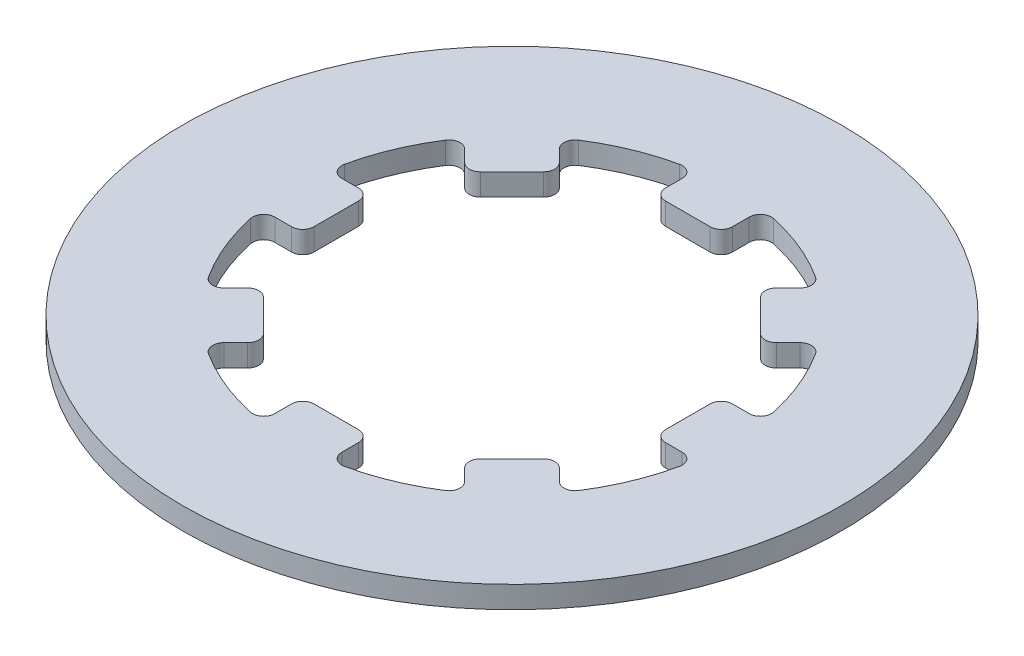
from build123d import *

# Parameters (mm, degrees)
SKETCH1_R           = 7.5
BOSS_EXTRUDE1_DEPTH = 0.5
FILLET2_R           = 0.254


with BuildPart() as part:
    # Sketch1 → Boss-Extrude1 (new body)
    with BuildSketch(Plane(origin=(0, 0, 0), x_dir=(1, 0, 0), z_dir=(0, 1, 0))):
        with Locations(Location((0, 0, 0), (0, 0, 270))):
            Circle(SKETCH1_R)
        with BuildLine():
            Line((-0.762, 4.94159448), (-0.762, 4))
            Line((-0.762, 4), (0.762, 4))
            Line((0.762, 4), (0.762, 4.94159448))
            ThreePointArc((0.762, 4.94159448), (1.913417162, 4.619397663), (2.955419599, 4.033050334))
            Line((2.955419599, 4.033050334), (2.289611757, 3.367242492))
            Line((2.289611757, 3.367242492), (3.367242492, 2.289611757))
            Line((3.367242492, 2.289611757), (4.033050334, 2.955419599))
            ThreePointArc((4.033050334, 2.955419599), (4.619397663, 1.913417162), (4.94159448, 0.762))
            Line((4.94159448, 0.762), (4, 0.762))
            Line((4, 0.762), (4, -0.762))
            Line((4, -0.762), (4.94159448, -0.762))
            ThreePointArc((4.94159448, -0.762), (4.619397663, -1.913417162), (4.033050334, -2.955419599))
            Line((4.033050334, -2.955419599), (3.367242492, -2.289611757))
            Line((3.367242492, -2.289611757), (2.289611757, -3.367242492))
            Line((2.289611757, -3.367242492), (2.955419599, -4.033050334))
            ThreePointArc((2.955419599, -4.033050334), (1.913417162, -4.619397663), (0.762, -4.94159448))
            Line((0.762, -4.94159448), (0.762, -4))
            Line((0.762, -4), (-0.762, -4))
            Line((-0.762, -4), (-0.762, -4.94159448))
            ThreePointArc((-0.762, -4.94159448), (-1.913417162, -4.619397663), (-2.955419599, -4.033050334))
            Line((-2.955419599, -4.033050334), (-2.289611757, -3.367242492))
            Line((-2.289611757, -3.367242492), (-3.367242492, -2.289611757))
            Line((-3.367242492, -2.289611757), (-4.033050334, -2.955419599))
            ThreePointArc((-4.033050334, -2.955419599), (-4.619397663, -1.913417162), (-4.94159448, -0.762))
            Line((-4.94159448, -0.762), (-4, -0.762))
            Line((-4, -0.762), (-4, 0.762))
            Line((-4, 0.762), (-4.94159448, 0.762))
            ThreePointArc((-4.94159448, 0.762), (-4.619397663, 1.913417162), (-4.033050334, 2.955419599))
            Line((-4.033050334, 2.955419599), (-3.367242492, 2.289611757))
            Line((-3.367242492, 2.289611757), (-2.289611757, 3.367242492))
            Line((-2.289611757, 3.367242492), (-2.955419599, 4.033050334))
            ThreePointArc((-2.955419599, 4.033050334), (-1.913417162, 4.619397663), (-0.762, 4.94159448))
        make_face(mode=Mode.SUBTRACT)
    extrude(amount=BOSS_EXTRUDE1_DEPTH)

    # Fillet2
    fillet2_edges = [part.edges().sort_by_distance(p)[0] for p in [
        (-0.762, 0.25, -4.94159448),
        (-2.955419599, 0.25, -4.033050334),
        (-2.289611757, 0.25, -3.367242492),
        (-3.367242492, 0.25, -2.289611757),
        (-4.033050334, 0.25, -2.955419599),
        (-4.94159448, 0.25, -0.762),
        (-4, 0.25, -0.762),
        (-4, 0.25, 0.762),
        (-4.94159448, 0.25, 0.762),
        (-4.033050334, 0.25, 2.955419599),
        (-3.367242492, 0.25, 2.289611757),
        (-2.289611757, 0.25, 3.367242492),
        (-2.955419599, 0.25, 4.033050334),
        (-0.762, 0.25, 4.94159448),
        (-0.762, 0.25, 4),
        (0.762, 0.25, 4),
        (0.762, 0.25, 4.94159448),
        (2.955419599, 0.25, 4.033050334),
        (2.289611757, 0.25, 3.367242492),
        (3.367242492, 0.25, 2.289611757),
        (4.033050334, 0.25, 2.955419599),
        (4.94159448, 0.25, 0.762),
        (4, 0.25, 0.762),
        (4, 0.25, -0.762),
        (4.94159448, 0.25, -0.762),
        (4.033050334, 0.25, -2.955419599),
        (3.367242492, 0.25, -2.289611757),
        (2.289611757, 0.25, -3.367242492),
        (2.955419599, 0.25, -4.033050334),
        (0.762, 0.25, -4.94159448),
        (0.762, 0.25, -4),
        (-0.762, 0.25, -4),
    ]]
    fillet(fillet2_edges, radius=FILLET2_R)


solid = part.part
